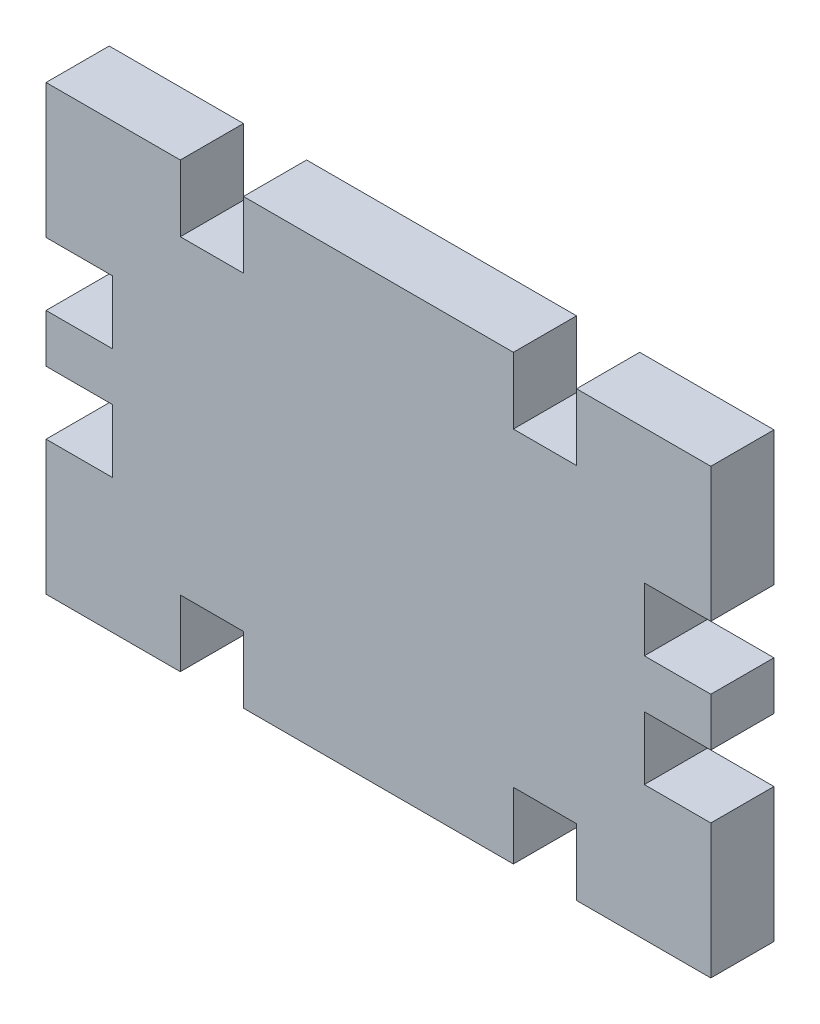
ISO-10303-21;
HEADER;
FILE_DESCRIPTION(('STEP AP214'),'2;1');
FILE_NAME('part.step','',(''),(''),'','','');
FILE_SCHEMA(('AUTOMOTIVE_DESIGN { 1 0 10303 214 1 1 1 1 }'));
ENDSEC;
DATA;
#1=APPLICATION_CONTEXT('core data for automotive mechanical design processes');
#2=APPLICATION_PROTOCOL_DEFINITION('international standard','automotive_design',2000,#1);
#3=PRODUCT_CONTEXT('',#1,'mechanical');
#4=PRODUCT('Part','Part','',(#3));
#5=PRODUCT_RELATED_PRODUCT_CATEGORY('part','',(#4));
#6=PRODUCT_DEFINITION_FORMATION('','',#4);
#7=PRODUCT_DEFINITION_CONTEXT('part definition',#1,'design');
#8=PRODUCT_DEFINITION('design','',#6,#7);
#9=PRODUCT_DEFINITION_SHAPE('','',#8);
#10=(LENGTH_UNIT() NAMED_UNIT(*) SI_UNIT(.MILLI.,.METRE.));
#11=(NAMED_UNIT(*) PLANE_ANGLE_UNIT() SI_UNIT($,.RADIAN.));
#12=(NAMED_UNIT(*) SI_UNIT($,.STERADIAN.) SOLID_ANGLE_UNIT());
#13=UNCERTAINTY_MEASURE_WITH_UNIT(LENGTH_MEASURE(1.E-05),#10,'distance_accuracy_value','');
#14=(GEOMETRIC_REPRESENTATION_CONTEXT(3) GLOBAL_UNCERTAINTY_ASSIGNED_CONTEXT((#13)) GLOBAL_UNIT_ASSIGNED_CONTEXT((#10,
#11,#12)) REPRESENTATION_CONTEXT('',''));
#15=CARTESIAN_POINT('',(0.,0.,0.));
#16=DIRECTION('',(0.,0.,1.));
#17=DIRECTION('',(1.,0.,0.));
#18=AXIS2_PLACEMENT_3D('',#15,#16,#17);
#19=CARTESIAN_POINT('',(21.6975142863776,12.7075775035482,5.7));
#20=DIRECTION('',(1.,0.,0.));
#21=DIRECTION('',(0.,1.,0.));
#22=AXIS2_PLACEMENT_3D('',#19,#20,#21);
#23=PLANE('',#22);
#24=DIRECTION('',(0.,-1.,0.));
#25=VECTOR('',#24,1.);
#26=CARTESIAN_POINT('',(21.6975142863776,12.7075775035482,0.));
#27=LINE('',#26,#25);
#28=CARTESIAN_POINT('',(21.6975142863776,-5.11077097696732,0.));
#29=VERTEX_POINT('',#28);
#30=CARTESIAN_POINT('',(21.6975142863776,-9.47407401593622,0.));
#31=VERTEX_POINT('',#30);
#32=EDGE_CURVE('E656',#29,#31,#27,.T.);
#33=ORIENTED_EDGE('',*,*,#32,.T.);
#34=DIRECTION('',(0.,0.,1.));
#35=VECTOR('',#34,1.);
#36=CARTESIAN_POINT('',(21.6975142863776,-9.47407401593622,-4.3));
#37=LINE('',#36,#35);
#38=CARTESIAN_POINT('',(21.6975142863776,-9.47407401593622,5.7));
#39=VERTEX_POINT('',#38);
#40=EDGE_CURVE('E421',#31,#39,#37,.T.);
#41=ORIENTED_EDGE('',*,*,#40,.T.);
#42=DIRECTION('',(0.,-1.,0.));
#43=VECTOR('',#42,1.);
#44=CARTESIAN_POINT('',(21.6975142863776,12.7075775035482,5.7));
#45=LINE('',#44,#43);
#46=CARTESIAN_POINT('',(21.6975142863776,-5.11077097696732,5.7));
#47=VERTEX_POINT('',#46);
#48=EDGE_CURVE('E288',#47,#39,#45,.T.);
#49=ORIENTED_EDGE('',*,*,#48,.F.);
#50=DIRECTION('',(0.,0.,1.));
#51=VECTOR('',#50,1.);
#52=CARTESIAN_POINT('',(21.6975142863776,-5.11077097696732,-4.3));
#53=LINE('',#52,#51);
#54=EDGE_CURVE('E457',#29,#47,#53,.T.);
#55=ORIENTED_EDGE('',*,*,#54,.F.);
#56=EDGE_LOOP('',(#33,#41,#49,#55));
#57=FACE_BOUND('',#56,.T.);
#58=ADVANCED_FACE('F32',(#57),#23,.F.);
#59=CARTESIAN_POINT('',(21.6975142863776,12.7075775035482,0.));
#60=VERTEX_POINT('',#59);
#61=CARTESIAN_POINT('',(21.6975142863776,0.589229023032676,0.));
#62=VERTEX_POINT('',#61);
#63=EDGE_CURVE('E643',#60,#62,#27,.T.);
#64=ORIENTED_EDGE('',*,*,#63,.T.);
#65=DIRECTION('',(0.,0.,1.));
#66=VECTOR('',#65,1.);
#67=CARTESIAN_POINT('',(21.6975142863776,0.589229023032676,-4.3));
#68=LINE('',#67,#66);
#69=CARTESIAN_POINT('',(21.6975142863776,0.589229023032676,5.7));
#70=VERTEX_POINT('',#69);
#71=EDGE_CURVE('E453',#62,#70,#68,.T.);
#72=ORIENTED_EDGE('',*,*,#71,.T.);
#73=CARTESIAN_POINT('',(21.6975142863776,12.7075775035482,5.7));
#74=VERTEX_POINT('',#73);
#75=EDGE_CURVE('E291',#74,#70,#45,.T.);
#76=ORIENTED_EDGE('',*,*,#75,.F.);
#77=DIRECTION('',(0.,0.,-1.));
#78=VECTOR('',#77,1.);
#79=CARTESIAN_POINT('',(21.6975142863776,12.7075775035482,5.7));
#80=LINE('',#79,#78);
#81=EDGE_CURVE('E331',#74,#60,#80,.T.);
#82=ORIENTED_EDGE('',*,*,#81,.T.);
#83=EDGE_LOOP('',(#64,#72,#76,#82));
#84=FACE_BOUND('',#83,.T.);
#85=ADVANCED_FACE('F642',(#84),#23,.F.);
#86=CARTESIAN_POINT('',(21.6975142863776,-27.2924224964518,5.7));
#87=DIRECTION('',(0.,1.,0.));
#88=DIRECTION('',(0.,0.,1.));
#89=AXIS2_PLACEMENT_3D('',#86,#87,#88);
#90=PLANE('',#89);
#91=DIRECTION('',(1.,0.,0.));
#92=VECTOR('',#91,1.);
#93=CARTESIAN_POINT('',(21.6975142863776,-27.2924224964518,0.));
#94=LINE('',#93,#92);
#95=CARTESIAN_POINT('',(39.5158627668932,-27.2924224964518,0.));
#96=VERTEX_POINT('',#95);
#97=CARTESIAN_POINT('',(63.8791658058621,-27.2924224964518,0.));
#98=VERTEX_POINT('',#97);
#99=EDGE_CURVE('E564',#96,#98,#94,.T.);
#100=ORIENTED_EDGE('',*,*,#99,.T.);
#101=DIRECTION('',(0.,0.,1.));
#102=VECTOR('',#101,1.);
#103=CARTESIAN_POINT('',(63.8791658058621,-27.2924224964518,-4.3));
#104=LINE('',#103,#102);
#105=CARTESIAN_POINT('',(63.8791658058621,-27.2924224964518,5.7));
#106=VERTEX_POINT('',#105);
#107=EDGE_CURVE('E481',#98,#106,#104,.T.);
#108=ORIENTED_EDGE('',*,*,#107,.T.);
#109=DIRECTION('',(1.,0.,0.));
#110=VECTOR('',#109,1.);
#111=CARTESIAN_POINT('',(21.6975142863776,-27.2924224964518,5.7));
#112=LINE('',#111,#110);
#113=CARTESIAN_POINT('',(39.5158627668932,-27.2924224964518,5.7));
#114=VERTEX_POINT('',#113);
#115=EDGE_CURVE('E303',#114,#106,#112,.T.);
#116=ORIENTED_EDGE('',*,*,#115,.F.);
#117=DIRECTION('',(0.,0.,1.));
#118=VECTOR('',#117,1.);
#119=CARTESIAN_POINT('',(39.5158627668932,-27.2924224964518,-4.3));
#120=LINE('',#119,#118);
#121=EDGE_CURVE('E541',#96,#114,#120,.T.);
#122=ORIENTED_EDGE('',*,*,#121,.F.);
#123=EDGE_LOOP('',(#100,#108,#116,#122));
#124=FACE_BOUND('',#123,.T.);
#125=ADVANCED_FACE('F563',(#124),#90,.F.);
#126=CARTESIAN_POINT('',(81.6975142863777,12.7075775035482,5.7));
#127=DIRECTION('',(-1.,0.,0.));
#128=DIRECTION('',(0.,-1.,0.));
#129=AXIS2_PLACEMENT_3D('',#126,#127,#128);
#130=PLANE('',#129);
#131=DIRECTION('',(0.,1.,0.));
#132=VECTOR('',#131,1.);
#133=CARTESIAN_POINT('',(81.6975142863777,12.7075775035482,0.));
#134=LINE('',#133,#132);
#135=CARTESIAN_POINT('',(81.6975142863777,-9.47407401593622,0.));
#136=VERTEX_POINT('',#135);
#137=CARTESIAN_POINT('',(81.6975142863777,-5.11077097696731,0.));
#138=VERTEX_POINT('',#137);
#139=EDGE_CURVE('E599',#136,#138,#134,.T.);
#140=ORIENTED_EDGE('',*,*,#139,.T.);
#141=DIRECTION('',(0.,0.,1.));
#142=VECTOR('',#141,1.);
#143=CARTESIAN_POINT('',(81.6975142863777,-5.11077097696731,-4.3));
#144=LINE('',#143,#142);
#145=CARTESIAN_POINT('',(81.6975142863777,-5.11077097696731,5.7));
#146=VERTEX_POINT('',#145);
#147=EDGE_CURVE('E447',#138,#146,#144,.T.);
#148=ORIENTED_EDGE('',*,*,#147,.T.);
#149=DIRECTION('',(0.,1.,0.));
#150=VECTOR('',#149,1.);
#151=CARTESIAN_POINT('',(81.6975142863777,12.7075775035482,5.7));
#152=LINE('',#151,#150);
#153=CARTESIAN_POINT('',(81.6975142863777,-9.47407401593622,5.7));
#154=VERTEX_POINT('',#153);
#155=EDGE_CURVE('E313',#154,#146,#152,.T.);
#156=ORIENTED_EDGE('',*,*,#155,.F.);
#157=DIRECTION('',(0.,0.,1.));
#158=VECTOR('',#157,1.);
#159=CARTESIAN_POINT('',(81.6975142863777,-9.47407401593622,-4.3));
#160=LINE('',#159,#158);
#161=EDGE_CURVE('E524',#136,#154,#160,.T.);
#162=ORIENTED_EDGE('',*,*,#161,.F.);
#163=EDGE_LOOP('',(#140,#148,#156,#162));
#164=FACE_BOUND('',#163,.T.);
#165=ADVANCED_FACE('F598',(#164),#130,.F.);
#166=CARTESIAN_POINT('',(81.6975142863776,-27.2924224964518,0.));
#167=VERTEX_POINT('',#166);
#168=CARTESIAN_POINT('',(81.6975142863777,-15.1740740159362,0.));
#169=VERTEX_POINT('',#168);
#170=EDGE_CURVE('E582',#167,#169,#134,.T.);
#171=ORIENTED_EDGE('',*,*,#170,.T.);
#172=DIRECTION('',(0.,0.,1.));
#173=VECTOR('',#172,1.);
#174=CARTESIAN_POINT('',(81.6975142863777,-15.1740740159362,-4.3));
#175=LINE('',#174,#173);
#176=CARTESIAN_POINT('',(81.6975142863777,-15.1740740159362,5.7));
#177=VERTEX_POINT('',#176);
#178=EDGE_CURVE('E520',#169,#177,#175,.T.);
#179=ORIENTED_EDGE('',*,*,#178,.T.);
#180=CARTESIAN_POINT('',(81.6975142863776,-27.2924224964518,5.7));
#181=VERTEX_POINT('',#180);
#182=EDGE_CURVE('E314',#181,#177,#152,.T.);
#183=ORIENTED_EDGE('',*,*,#182,.F.);
#184=DIRECTION('',(0.,0.,-1.));
#185=VECTOR('',#184,1.);
#186=CARTESIAN_POINT('',(81.6975142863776,-27.2924224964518,5.7));
#187=LINE('',#186,#185);
#188=EDGE_CURVE('E341',#181,#167,#187,.T.);
#189=ORIENTED_EDGE('',*,*,#188,.T.);
#190=EDGE_LOOP('',(#171,#179,#183,#189));
#191=FACE_BOUND('',#190,.T.);
#192=ADVANCED_FACE('F581',(#191),#130,.F.);
#193=CARTESIAN_POINT('',(21.6975142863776,12.7075775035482,5.7));
#194=DIRECTION('',(0.,-1.,0.));
#195=DIRECTION('',(0.,0.,-1.));
#196=AXIS2_PLACEMENT_3D('',#193,#194,#195);
#197=PLANE('',#196);
#198=DIRECTION('',(-1.,0.,0.));
#199=VECTOR('',#198,1.);
#200=CARTESIAN_POINT('',(21.6975142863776,12.7075775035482,0.));
#201=LINE('',#200,#199);
#202=CARTESIAN_POINT('',(63.8791658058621,12.7075775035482,0.));
#203=VERTEX_POINT('',#202);
#204=CARTESIAN_POINT('',(39.5158627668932,12.7075775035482,0.));
#205=VERTEX_POINT('',#204);
#206=EDGE_CURVE('E294',#203,#205,#201,.T.);
#207=ORIENTED_EDGE('',*,*,#206,.T.);
#208=DIRECTION('',(0.,0.,1.));
#209=VECTOR('',#208,1.);
#210=CARTESIAN_POINT('',(39.5158627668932,12.7075775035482,-4.3));
#211=LINE('',#210,#209);
#212=CARTESIAN_POINT('',(39.5158627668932,12.7075775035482,5.7));
#213=VERTEX_POINT('',#212);
#214=EDGE_CURVE('E283',#205,#213,#211,.T.);
#215=ORIENTED_EDGE('',*,*,#214,.T.);
#216=DIRECTION('',(-1.,0.,0.));
#217=VECTOR('',#216,1.);
#218=CARTESIAN_POINT('',(21.6975142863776,12.7075775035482,5.7));
#219=LINE('',#218,#217);
#220=CARTESIAN_POINT('',(63.8791658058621,12.7075775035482,5.7));
#221=VERTEX_POINT('',#220);
#222=EDGE_CURVE('E324',#221,#213,#219,.T.);
#223=ORIENTED_EDGE('',*,*,#222,.F.);
#224=DIRECTION('',(0.,0.,1.));
#225=VECTOR('',#224,1.);
#226=CARTESIAN_POINT('',(63.8791658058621,12.7075775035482,-4.3));
#227=LINE('',#226,#225);
#228=EDGE_CURVE('E491',#203,#221,#227,.T.);
#229=ORIENTED_EDGE('',*,*,#228,.F.);
#230=EDGE_LOOP('',(#207,#215,#223,#229));
#231=FACE_BOUND('',#230,.T.);
#232=ADVANCED_FACE('F631',(#231),#197,.F.);
#233=CARTESIAN_POINT('',(81.6975142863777,12.7075775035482,0.));
#234=VERTEX_POINT('',#233);
#235=CARTESIAN_POINT('',(69.5791658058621,12.7075775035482,0.));
#236=VERTEX_POINT('',#235);
#237=EDGE_CURVE('E289',#234,#236,#201,.T.);
#238=ORIENTED_EDGE('',*,*,#237,.T.);
#239=DIRECTION('',(0.,0.,1.));
#240=VECTOR('',#239,1.);
#241=CARTESIAN_POINT('',(69.5791658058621,12.7075775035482,-4.3));
#242=LINE('',#241,#240);
#243=CARTESIAN_POINT('',(69.5791658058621,12.7075775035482,5.7));
#244=VERTEX_POINT('',#243);
#245=EDGE_CURVE('E487',#236,#244,#242,.T.);
#246=ORIENTED_EDGE('',*,*,#245,.T.);
#247=CARTESIAN_POINT('',(81.6975142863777,12.7075775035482,5.7));
#248=VERTEX_POINT('',#247);
#249=EDGE_CURVE('E325',#248,#244,#219,.T.);
#250=ORIENTED_EDGE('',*,*,#249,.F.);
#251=DIRECTION('',(0.,0.,-1.));
#252=VECTOR('',#251,1.);
#253=CARTESIAN_POINT('',(81.6975142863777,12.7075775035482,5.7));
#254=LINE('',#253,#252);
#255=EDGE_CURVE('E335',#248,#234,#254,.T.);
#256=ORIENTED_EDGE('',*,*,#255,.T.);
#257=EDGE_LOOP('',(#238,#246,#250,#256));
#258=FACE_BOUND('',#257,.T.);
#259=ADVANCED_FACE('F615',(#258),#197,.F.);
#260=CARTESIAN_POINT('',(21.6975142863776,-27.2924224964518,0.));
#261=VERTEX_POINT('',#260);
#262=CARTESIAN_POINT('',(33.8158627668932,-27.2924224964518,0.));
#263=VERTEX_POINT('',#262);
#264=EDGE_CURVE('E547',#261,#263,#94,.T.);
#265=ORIENTED_EDGE('',*,*,#264,.T.);
#266=DIRECTION('',(0.,0.,1.));
#267=VECTOR('',#266,1.);
#268=CARTESIAN_POINT('',(33.8158627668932,-27.2924224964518,-4.3));
#269=LINE('',#268,#267);
#270=CARTESIAN_POINT('',(33.8158627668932,-27.2924224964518,5.7));
#271=VERTEX_POINT('',#270);
#272=EDGE_CURVE('E535',#263,#271,#269,.T.);
#273=ORIENTED_EDGE('',*,*,#272,.T.);
#274=CARTESIAN_POINT('',(21.6975142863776,-27.2924224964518,5.7));
#275=VERTEX_POINT('',#274);
#276=EDGE_CURVE('E304',#275,#271,#112,.T.);
#277=ORIENTED_EDGE('',*,*,#276,.F.);
#278=DIRECTION('',(0.,0.,-1.));
#279=VECTOR('',#278,1.);
#280=CARTESIAN_POINT('',(21.6975142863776,-27.2924224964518,5.7));
#281=LINE('',#280,#279);
#282=EDGE_CURVE('E287',#275,#261,#281,.T.);
#283=ORIENTED_EDGE('',*,*,#282,.T.);
#284=EDGE_LOOP('',(#265,#273,#277,#283));
#285=FACE_BOUND('',#284,.T.);
#286=ADVANCED_FACE('F545',(#285),#90,.F.);
#287=CARTESIAN_POINT('',(21.6975142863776,-15.1740740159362,5.7));
#288=VERTEX_POINT('',#287);
#289=EDGE_CURVE('E279',#288,#275,#45,.T.);
#290=ORIENTED_EDGE('',*,*,#289,.F.);
#291=DIRECTION('',(0.,0.,1.));
#292=VECTOR('',#291,1.);
#293=CARTESIAN_POINT('',(21.6975142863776,-15.1740740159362,-4.3));
#294=LINE('',#293,#292);
#295=CARTESIAN_POINT('',(21.6975142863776,-15.1740740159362,0.));
#296=VERTEX_POINT('',#295);
#297=EDGE_CURVE('E263',#296,#288,#294,.T.);
#298=ORIENTED_EDGE('',*,*,#297,.F.);
#299=EDGE_CURVE('E538',#296,#261,#27,.T.);
#300=ORIENTED_EDGE('',*,*,#299,.T.);
#301=ORIENTED_EDGE('',*,*,#282,.F.);
#302=EDGE_LOOP('',(#290,#298,#300,#301));
#303=FACE_BOUND('',#302,.T.);
#304=ADVANCED_FACE('F34',(#303),#23,.F.);
#305=CARTESIAN_POINT('',(69.5791658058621,-27.2924224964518,5.7));
#306=VERTEX_POINT('',#305);
#307=EDGE_CURVE('E300',#306,#181,#112,.T.);
#308=ORIENTED_EDGE('',*,*,#307,.F.);
#309=DIRECTION('',(0.,0.,1.));
#310=VECTOR('',#309,1.);
#311=CARTESIAN_POINT('',(69.5791658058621,-27.2924224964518,-4.3));
#312=LINE('',#311,#310);
#313=CARTESIAN_POINT('',(69.5791658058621,-27.2924224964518,0.));
#314=VERTEX_POINT('',#313);
#315=EDGE_CURVE('E504',#314,#306,#312,.T.);
#316=ORIENTED_EDGE('',*,*,#315,.F.);
#317=EDGE_CURVE('E577',#314,#167,#94,.T.);
#318=ORIENTED_EDGE('',*,*,#317,.T.);
#319=ORIENTED_EDGE('',*,*,#188,.F.);
#320=EDGE_LOOP('',(#308,#316,#318,#319));
#321=FACE_BOUND('',#320,.T.);
#322=ADVANCED_FACE('F576',(#321),#90,.F.);
#323=CARTESIAN_POINT('',(81.6975142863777,0.589229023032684,5.7));
#324=VERTEX_POINT('',#323);
#325=EDGE_CURVE('E311',#324,#248,#152,.T.);
#326=ORIENTED_EDGE('',*,*,#325,.F.);
#327=DIRECTION('',(0.,0.,1.));
#328=VECTOR('',#327,1.);
#329=CARTESIAN_POINT('',(81.6975142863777,0.589229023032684,-4.3));
#330=LINE('',#329,#328);
#331=CARTESIAN_POINT('',(81.6975142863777,0.589229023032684,0.));
#332=VERTEX_POINT('',#331);
#333=EDGE_CURVE('E470',#332,#324,#330,.T.);
#334=ORIENTED_EDGE('',*,*,#333,.F.);
#335=EDGE_CURVE('E612',#332,#234,#134,.T.);
#336=ORIENTED_EDGE('',*,*,#335,.T.);
#337=ORIENTED_EDGE('',*,*,#255,.F.);
#338=EDGE_LOOP('',(#326,#334,#336,#337));
#339=FACE_BOUND('',#338,.T.);
#340=ADVANCED_FACE('F611',(#339),#130,.F.);
#341=CARTESIAN_POINT('',(33.8158627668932,12.7075775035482,5.7));
#342=VERTEX_POINT('',#341);
#343=EDGE_CURVE('E321',#342,#74,#219,.T.);
#344=ORIENTED_EDGE('',*,*,#343,.F.);
#345=DIRECTION('',(0.,0.,1.));
#346=VECTOR('',#345,1.);
#347=CARTESIAN_POINT('',(33.8158627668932,12.7075775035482,-4.3));
#348=LINE('',#347,#346);
#349=CARTESIAN_POINT('',(33.8158627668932,12.7075775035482,0.));
#350=VERTEX_POINT('',#349);
#351=EDGE_CURVE('E437',#350,#342,#348,.T.);
#352=ORIENTED_EDGE('',*,*,#351,.F.);
#353=EDGE_CURVE('E296',#350,#60,#201,.T.);
#354=ORIENTED_EDGE('',*,*,#353,.T.);
#355=ORIENTED_EDGE('',*,*,#81,.F.);
#356=EDGE_LOOP('',(#344,#352,#354,#355));
#357=FACE_BOUND('',#356,.T.);
#358=ADVANCED_FACE('F641',(#357),#197,.F.);
#359=CARTESIAN_POINT('',(0.,0.,5.7));
#360=DIRECTION('',(0.,0.,1.));
#361=DIRECTION('',(1.,0.,0.));
#362=AXIS2_PLACEMENT_3D('',#359,#360,#361);
#363=PLANE('',#362);
#364=DIRECTION('',(-1.,0.,0.));
#365=VECTOR('',#364,1.);
#366=CARTESIAN_POINT('',(21.6975142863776,-9.47407401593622,5.7));
#367=LINE('',#366,#365);
#368=CARTESIAN_POINT('',(27.6975142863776,-9.47407401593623,5.7));
#369=VERTEX_POINT('',#368);
#370=EDGE_CURVE('E273',#369,#39,#367,.T.);
#371=ORIENTED_EDGE('',*,*,#370,.F.);
#372=DIRECTION('',(0.,1.,0.));
#373=VECTOR('',#372,1.);
#374=CARTESIAN_POINT('',(27.6975142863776,-15.1740740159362,5.7));
#375=LINE('',#374,#373);
#376=CARTESIAN_POINT('',(27.6975142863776,-15.1740740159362,5.7));
#377=VERTEX_POINT('',#376);
#378=EDGE_CURVE('E282',#377,#369,#375,.T.);
#379=ORIENTED_EDGE('',*,*,#378,.F.);
#380=DIRECTION('',(1.,0.,0.));
#381=VECTOR('',#380,1.);
#382=CARTESIAN_POINT('',(21.6975142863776,-15.1740740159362,5.7));
#383=LINE('',#382,#381);
#384=EDGE_CURVE('E266',#288,#377,#383,.T.);
#385=ORIENTED_EDGE('',*,*,#384,.F.);
#386=ORIENTED_EDGE('',*,*,#289,.T.);
#387=ORIENTED_EDGE('',*,*,#276,.T.);
#388=DIRECTION('',(0.,-1.,0.));
#389=VECTOR('',#388,1.);
#390=CARTESIAN_POINT('',(33.8158627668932,-27.2924224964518,5.7));
#391=LINE('',#390,#389);
#392=CARTESIAN_POINT('',(33.8158627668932,-21.2924224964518,5.7));
#393=VERTEX_POINT('',#392);
#394=EDGE_CURVE('E424',#393,#271,#391,.T.);
#395=ORIENTED_EDGE('',*,*,#394,.F.);
#396=DIRECTION('',(-1.,0.,0.));
#397=VECTOR('',#396,1.);
#398=CARTESIAN_POINT('',(33.8158627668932,-21.2924224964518,5.7));
#399=LINE('',#398,#397);
#400=CARTESIAN_POINT('',(39.5158627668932,-21.2924224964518,5.7));
#401=VERTEX_POINT('',#400);
#402=EDGE_CURVE('E532',#401,#393,#399,.T.);
#403=ORIENTED_EDGE('',*,*,#402,.F.);
#404=DIRECTION('',(0.,1.,0.));
#405=VECTOR('',#404,1.);
#406=CARTESIAN_POINT('',(39.5158627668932,-27.2924224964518,5.7));
#407=LINE('',#406,#405);
#408=EDGE_CURVE('E529',#114,#401,#407,.T.);
#409=ORIENTED_EDGE('',*,*,#408,.F.);
#410=ORIENTED_EDGE('',*,*,#115,.T.);
#411=DIRECTION('',(0.,-1.,0.));
#412=VECTOR('',#411,1.);
#413=CARTESIAN_POINT('',(63.8791658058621,-27.2924224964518,5.7));
#414=LINE('',#413,#412);
#415=CARTESIAN_POINT('',(63.8791658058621,-21.2924224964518,5.7));
#416=VERTEX_POINT('',#415);
#417=EDGE_CURVE('E502',#416,#106,#414,.T.);
#418=ORIENTED_EDGE('',*,*,#417,.F.);
#419=DIRECTION('',(-1.,0.,0.));
#420=VECTOR('',#419,1.);
#421=CARTESIAN_POINT('',(69.5791658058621,-21.2924224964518,5.7));
#422=LINE('',#421,#420);
#423=CARTESIAN_POINT('',(69.5791658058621,-21.2924224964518,5.7));
#424=VERTEX_POINT('',#423);
#425=EDGE_CURVE('E498',#424,#416,#422,.T.);
#426=ORIENTED_EDGE('',*,*,#425,.F.);
#427=DIRECTION('',(0.,1.,0.));
#428=VECTOR('',#427,1.);
#429=CARTESIAN_POINT('',(69.5791658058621,-27.2924224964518,5.7));
#430=LINE('',#429,#428);
#431=EDGE_CURVE('E495',#306,#424,#430,.T.);
#432=ORIENTED_EDGE('',*,*,#431,.F.);
#433=ORIENTED_EDGE('',*,*,#307,.T.);
#434=ORIENTED_EDGE('',*,*,#182,.T.);
#435=DIRECTION('',(1.,0.,0.));
#436=VECTOR('',#435,1.);
#437=CARTESIAN_POINT('',(81.6975142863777,-15.1740740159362,5.7));
#438=LINE('',#437,#436);
#439=CARTESIAN_POINT('',(75.6975142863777,-15.1740740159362,5.7));
#440=VERTEX_POINT('',#439);
#441=EDGE_CURVE('E512',#440,#177,#438,.T.);
#442=ORIENTED_EDGE('',*,*,#441,.F.);
#443=DIRECTION('',(0.,-1.,0.));
#444=VECTOR('',#443,1.);
#445=CARTESIAN_POINT('',(75.6975142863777,-15.1740740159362,5.7));
#446=LINE('',#445,#444);
#447=CARTESIAN_POINT('',(75.6975142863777,-9.47407401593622,5.7));
#448=VERTEX_POINT('',#447);
#449=EDGE_CURVE('E517',#448,#440,#446,.T.);
#450=ORIENTED_EDGE('',*,*,#449,.F.);
#451=DIRECTION('',(-1.,0.,0.));
#452=VECTOR('',#451,1.);
#453=CARTESIAN_POINT('',(81.6975142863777,-9.47407401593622,5.7));
#454=LINE('',#453,#452);
#455=EDGE_CURVE('E514',#154,#448,#454,.T.);
#456=ORIENTED_EDGE('',*,*,#455,.F.);
#457=ORIENTED_EDGE('',*,*,#155,.T.);
#458=DIRECTION('',(1.,0.,0.));
#459=VECTOR('',#458,1.);
#460=CARTESIAN_POINT('',(81.6975142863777,-5.11077097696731,5.7));
#461=LINE('',#460,#459);
#462=CARTESIAN_POINT('',(75.6975142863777,-5.11077097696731,5.7));
#463=VERTEX_POINT('',#462);
#464=EDGE_CURVE('E468',#463,#146,#461,.T.);
#465=ORIENTED_EDGE('',*,*,#464,.F.);
#466=DIRECTION('',(0.,-1.,0.));
#467=VECTOR('',#466,1.);
#468=CARTESIAN_POINT('',(75.6975142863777,0.589229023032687,5.7));
#469=LINE('',#468,#467);
#470=CARTESIAN_POINT('',(75.6975142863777,0.589229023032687,5.7));
#471=VERTEX_POINT('',#470);
#472=EDGE_CURVE('E464',#471,#463,#469,.T.);
#473=ORIENTED_EDGE('',*,*,#472,.F.);
#474=DIRECTION('',(-1.,0.,0.));
#475=VECTOR('',#474,1.);
#476=CARTESIAN_POINT('',(81.6975142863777,0.589229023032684,5.7));
#477=LINE('',#476,#475);
#478=EDGE_CURVE('E461',#324,#471,#477,.T.);
#479=ORIENTED_EDGE('',*,*,#478,.F.);
#480=ORIENTED_EDGE('',*,*,#325,.T.);
#481=ORIENTED_EDGE('',*,*,#249,.T.);
#482=DIRECTION('',(0.,1.,0.));
#483=VECTOR('',#482,1.);
#484=CARTESIAN_POINT('',(69.5791658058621,12.7075775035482,5.7));
#485=LINE('',#484,#483);
#486=CARTESIAN_POINT('',(69.5791658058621,6.70757750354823,5.7));
#487=VERTEX_POINT('',#486);
#488=EDGE_CURVE('E478',#487,#244,#485,.T.);
#489=ORIENTED_EDGE('',*,*,#488,.F.);
#490=DIRECTION('',(1.,0.,0.));
#491=VECTOR('',#490,1.);
#492=CARTESIAN_POINT('',(69.5791658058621,6.70757750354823,5.7));
#493=LINE('',#492,#491);
#494=CARTESIAN_POINT('',(63.8791658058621,6.70757750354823,5.7));
#495=VERTEX_POINT('',#494);
#496=EDGE_CURVE('E484',#495,#487,#493,.T.);
#497=ORIENTED_EDGE('',*,*,#496,.F.);
#498=DIRECTION('',(0.,-1.,0.));
#499=VECTOR('',#498,1.);
#500=CARTESIAN_POINT('',(63.8791658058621,12.7075775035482,5.7));
#501=LINE('',#500,#499);
#502=EDGE_CURVE('E480',#221,#495,#501,.T.);
#503=ORIENTED_EDGE('',*,*,#502,.F.);
#504=ORIENTED_EDGE('',*,*,#222,.T.);
#505=DIRECTION('',(0.,1.,0.));
#506=VECTOR('',#505,1.);
#507=CARTESIAN_POINT('',(39.5158627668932,12.7075775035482,5.7));
#508=LINE('',#507,#506);
#509=CARTESIAN_POINT('',(39.5158627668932,6.70757750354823,5.7));
#510=VERTEX_POINT('',#509);
#511=EDGE_CURVE('E435',#510,#213,#508,.T.);
#512=ORIENTED_EDGE('',*,*,#511,.F.);
#513=DIRECTION('',(1.,0.,0.));
#514=VECTOR('',#513,1.);
#515=CARTESIAN_POINT('',(33.8158627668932,6.70757750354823,5.7));
#516=LINE('',#515,#514);
#517=CARTESIAN_POINT('',(33.8158627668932,6.70757750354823,5.7));
#518=VERTEX_POINT('',#517);
#519=EDGE_CURVE('E431',#518,#510,#516,.T.);
#520=ORIENTED_EDGE('',*,*,#519,.F.);
#521=DIRECTION('',(0.,-1.,0.));
#522=VECTOR('',#521,1.);
#523=CARTESIAN_POINT('',(33.8158627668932,12.7075775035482,5.7));
#524=LINE('',#523,#522);
#525=EDGE_CURVE('E429',#342,#518,#524,.T.);
#526=ORIENTED_EDGE('',*,*,#525,.F.);
#527=ORIENTED_EDGE('',*,*,#343,.T.);
#528=ORIENTED_EDGE('',*,*,#75,.T.);
#529=DIRECTION('',(-1.,0.,0.));
#530=VECTOR('',#529,1.);
#531=CARTESIAN_POINT('',(21.6975142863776,0.589229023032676,5.7));
#532=LINE('',#531,#530);
#533=CARTESIAN_POINT('',(27.6975142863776,0.589229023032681,5.7));
#534=VERTEX_POINT('',#533);
#535=EDGE_CURVE('E444',#534,#70,#532,.T.);
#536=ORIENTED_EDGE('',*,*,#535,.F.);
#537=DIRECTION('',(0.,1.,0.));
#538=VECTOR('',#537,1.);
#539=CARTESIAN_POINT('',(27.6975142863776,0.589229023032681,5.7));
#540=LINE('',#539,#538);
#541=CARTESIAN_POINT('',(27.6975142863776,-5.11077097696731,5.7));
#542=VERTEX_POINT('',#541);
#543=EDGE_CURVE('E450',#542,#534,#540,.T.);
#544=ORIENTED_EDGE('',*,*,#543,.F.);
#545=DIRECTION('',(1.,0.,0.));
#546=VECTOR('',#545,1.);
#547=CARTESIAN_POINT('',(21.6975142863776,-5.11077097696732,5.7));
#548=LINE('',#547,#546);
#549=EDGE_CURVE('E446',#47,#542,#548,.T.);
#550=ORIENTED_EDGE('',*,*,#549,.F.);
#551=ORIENTED_EDGE('',*,*,#48,.T.);
#552=EDGE_LOOP('',(#371,#379,#385,#386,#387,#395,#403,#409,#410,#418,#426,#432,#433,#434,#442,
#450,#456,#457,#465,#473,#479,#480,#481,#489,#497,#503,#504,#512,#520,#526,#527,#528,#536,#544,
#550,#551));
#553=FACE_BOUND('',#552,.T.);
#554=ADVANCED_FACE('F277',(#553),#363,.T.);
#555=CARTESIAN_POINT('',(0.,0.,0.));
#556=DIRECTION('',(0.,0.,1.));
#557=DIRECTION('',(1.,0.,0.));
#558=AXIS2_PLACEMENT_3D('',#555,#556,#557);
#559=PLANE('',#558);
#560=DIRECTION('',(0.,1.,0.));
#561=VECTOR('',#560,1.);
#562=CARTESIAN_POINT('',(27.6975142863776,0.,0.));
#563=LINE('',#562,#561);
#564=CARTESIAN_POINT('',(27.6975142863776,-15.1740740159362,0.));
#565=VERTEX_POINT('',#564);
#566=CARTESIAN_POINT('',(27.6975142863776,-9.47407401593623,0.));
#567=VERTEX_POINT('',#566);
#568=EDGE_CURVE('E40',#565,#567,#563,.T.);
#569=ORIENTED_EDGE('',*,*,#568,.T.);
#570=DIRECTION('',(-1.,0.,0.));
#571=VECTOR('',#570,1.);
#572=CARTESIAN_POINT('',(0.,-9.47407401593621,0.));
#573=LINE('',#572,#571);
#574=EDGE_CURVE('E11',#567,#31,#573,.T.);
#575=ORIENTED_EDGE('',*,*,#574,.T.);
#576=ORIENTED_EDGE('',*,*,#32,.F.);
#577=DIRECTION('',(1.,0.,0.));
#578=VECTOR('',#577,1.);
#579=CARTESIAN_POINT('',(0.,-5.11077097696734,0.));
#580=LINE('',#579,#578);
#581=CARTESIAN_POINT('',(27.6975142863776,-5.11077097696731,0.));
#582=VERTEX_POINT('',#581);
#583=EDGE_CURVE('E393',#29,#582,#580,.T.);
#584=ORIENTED_EDGE('',*,*,#583,.T.);
#585=DIRECTION('',(0.,1.,0.));
#586=VECTOR('',#585,1.);
#587=CARTESIAN_POINT('',(27.6975142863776,0.,0.));
#588=LINE('',#587,#586);
#589=CARTESIAN_POINT('',(27.6975142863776,0.589229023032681,0.));
#590=VERTEX_POINT('',#589);
#591=EDGE_CURVE('E396',#582,#590,#588,.T.);
#592=ORIENTED_EDGE('',*,*,#591,.T.);
#593=DIRECTION('',(-1.,0.,0.));
#594=VECTOR('',#593,1.);
#595=CARTESIAN_POINT('',(0.,0.589229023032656,0.));
#596=LINE('',#595,#594);
#597=EDGE_CURVE('E399',#590,#62,#596,.T.);
#598=ORIENTED_EDGE('',*,*,#597,.T.);
#599=ORIENTED_EDGE('',*,*,#63,.F.);
#600=ORIENTED_EDGE('',*,*,#353,.F.);
#601=DIRECTION('',(0.,-1.,0.));
#602=VECTOR('',#601,1.);
#603=CARTESIAN_POINT('',(33.8158627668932,0.,0.));
#604=LINE('',#603,#602);
#605=CARTESIAN_POINT('',(33.8158627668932,6.70757750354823,0.));
#606=VERTEX_POINT('',#605);
#607=EDGE_CURVE('E402',#350,#606,#604,.T.);
#608=ORIENTED_EDGE('',*,*,#607,.T.);
#609=DIRECTION('',(1.,0.,0.));
#610=VECTOR('',#609,1.);
#611=CARTESIAN_POINT('',(0.,6.70757750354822,0.));
#612=LINE('',#611,#610);
#613=CARTESIAN_POINT('',(39.5158627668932,6.70757750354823,0.));
#614=VERTEX_POINT('',#613);
#615=EDGE_CURVE('E405',#606,#614,#612,.T.);
#616=ORIENTED_EDGE('',*,*,#615,.T.);
#617=DIRECTION('',(0.,1.,0.));
#618=VECTOR('',#617,1.);
#619=CARTESIAN_POINT('',(39.5158627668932,0.,0.));
#620=LINE('',#619,#618);
#621=EDGE_CURVE('E408',#614,#205,#620,.T.);
#622=ORIENTED_EDGE('',*,*,#621,.T.);
#623=ORIENTED_EDGE('',*,*,#206,.F.);
#624=DIRECTION('',(0.,-1.,0.));
#625=VECTOR('',#624,1.);
#626=CARTESIAN_POINT('',(63.8791658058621,0.,0.));
#627=LINE('',#626,#625);
#628=CARTESIAN_POINT('',(63.8791658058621,6.70757750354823,0.));
#629=VERTEX_POINT('',#628);
#630=EDGE_CURVE('E375',#203,#629,#627,.T.);
#631=ORIENTED_EDGE('',*,*,#630,.T.);
#632=DIRECTION('',(1.,0.,0.));
#633=VECTOR('',#632,1.);
#634=CARTESIAN_POINT('',(0.,6.70757750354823,0.));
#635=LINE('',#634,#633);
#636=CARTESIAN_POINT('',(69.5791658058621,6.70757750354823,0.));
#637=VERTEX_POINT('',#636);
#638=EDGE_CURVE('E378',#629,#637,#635,.T.);
#639=ORIENTED_EDGE('',*,*,#638,.T.);
#640=DIRECTION('',(0.,1.,0.));
#641=VECTOR('',#640,1.);
#642=CARTESIAN_POINT('',(69.5791658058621,1.60934149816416E-13,0.));
#643=LINE('',#642,#641);
#644=EDGE_CURVE('E381',#637,#236,#643,.T.);
#645=ORIENTED_EDGE('',*,*,#644,.T.);
#646=ORIENTED_EDGE('',*,*,#237,.F.);
#647=ORIENTED_EDGE('',*,*,#335,.F.);
#648=DIRECTION('',(-1.,0.,0.));
#649=VECTOR('',#648,1.);
#650=CARTESIAN_POINT('',(0.,0.589229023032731,0.));
#651=LINE('',#650,#649);
#652=CARTESIAN_POINT('',(75.6975142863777,0.589229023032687,0.));
#653=VERTEX_POINT('',#652);
#654=EDGE_CURVE('E384',#332,#653,#651,.T.);
#655=ORIENTED_EDGE('',*,*,#654,.T.);
#656=DIRECTION('',(0.,-1.,0.));
#657=VECTOR('',#656,1.);
#658=CARTESIAN_POINT('',(75.6975142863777,0.,0.));
#659=LINE('',#658,#657);
#660=CARTESIAN_POINT('',(75.6975142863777,-5.11077097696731,0.));
#661=VERTEX_POINT('',#660);
#662=EDGE_CURVE('E387',#653,#661,#659,.T.);
#663=ORIENTED_EDGE('',*,*,#662,.T.);
#664=DIRECTION('',(1.,0.,0.));
#665=VECTOR('',#664,1.);
#666=CARTESIAN_POINT('',(0.,-5.11077097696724,0.));
#667=LINE('',#666,#665);
#668=EDGE_CURVE('E390',#661,#138,#667,.T.);
#669=ORIENTED_EDGE('',*,*,#668,.T.);
#670=ORIENTED_EDGE('',*,*,#139,.F.);
#671=DIRECTION('',(-1.,0.,0.));
#672=VECTOR('',#671,1.);
#673=CARTESIAN_POINT('',(0.,-9.47407401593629,0.));
#674=LINE('',#673,#672);
#675=CARTESIAN_POINT('',(75.6975142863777,-9.47407401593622,0.));
#676=VERTEX_POINT('',#675);
#677=EDGE_CURVE('E357',#136,#676,#674,.T.);
#678=ORIENTED_EDGE('',*,*,#677,.T.);
#679=DIRECTION('',(0.,-1.,0.));
#680=VECTOR('',#679,1.);
#681=CARTESIAN_POINT('',(75.6975142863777,0.,0.));
#682=LINE('',#681,#680);
#683=CARTESIAN_POINT('',(75.6975142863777,-15.1740740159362,0.));
#684=VERTEX_POINT('',#683);
#685=EDGE_CURVE('E360',#676,#684,#682,.T.);
#686=ORIENTED_EDGE('',*,*,#685,.T.);
#687=DIRECTION('',(1.,0.,0.));
#688=VECTOR('',#687,1.);
#689=CARTESIAN_POINT('',(0.,-15.1740740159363,0.));
#690=LINE('',#689,#688);
#691=EDGE_CURVE('E363',#684,#169,#690,.T.);
#692=ORIENTED_EDGE('',*,*,#691,.T.);
#693=ORIENTED_EDGE('',*,*,#170,.F.);
#694=ORIENTED_EDGE('',*,*,#317,.F.);
#695=DIRECTION('',(0.,1.,0.));
#696=VECTOR('',#695,1.);
#697=CARTESIAN_POINT('',(69.5791658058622,-1.60934149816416E-13,0.));
#698=LINE('',#697,#696);
#699=CARTESIAN_POINT('',(69.5791658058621,-21.2924224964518,0.));
#700=VERTEX_POINT('',#699);
#701=EDGE_CURVE('E366',#314,#700,#698,.T.);
#702=ORIENTED_EDGE('',*,*,#701,.T.);
#703=DIRECTION('',(-1.,0.,0.));
#704=VECTOR('',#703,1.);
#705=CARTESIAN_POINT('',(0.,-21.2924224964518,0.));
#706=LINE('',#705,#704);
#707=CARTESIAN_POINT('',(63.8791658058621,-21.2924224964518,0.));
#708=VERTEX_POINT('',#707);
#709=EDGE_CURVE('E369',#700,#708,#706,.T.);
#710=ORIENTED_EDGE('',*,*,#709,.T.);
#711=DIRECTION('',(0.,-1.,0.));
#712=VECTOR('',#711,1.);
#713=CARTESIAN_POINT('',(63.8791658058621,0.,0.));
#714=LINE('',#713,#712);
#715=EDGE_CURVE('E372',#708,#98,#714,.T.);
#716=ORIENTED_EDGE('',*,*,#715,.T.);
#717=ORIENTED_EDGE('',*,*,#99,.F.);
#718=DIRECTION('',(0.,1.,0.));
#719=VECTOR('',#718,1.);
#720=CARTESIAN_POINT('',(39.5158627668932,0.,0.));
#721=LINE('',#720,#719);
#722=CARTESIAN_POINT('',(39.5158627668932,-21.2924224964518,0.));
#723=VERTEX_POINT('',#722);
#724=EDGE_CURVE('E348',#96,#723,#721,.T.);
#725=ORIENTED_EDGE('',*,*,#724,.T.);
#726=DIRECTION('',(-1.,0.,0.));
#727=VECTOR('',#726,1.);
#728=CARTESIAN_POINT('',(0.,-21.2924224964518,0.));
#729=LINE('',#728,#727);
#730=CARTESIAN_POINT('',(33.8158627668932,-21.2924224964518,0.));
#731=VERTEX_POINT('',#730);
#732=EDGE_CURVE('E351',#723,#731,#729,.T.);
#733=ORIENTED_EDGE('',*,*,#732,.T.);
#734=DIRECTION('',(0.,-1.,0.));
#735=VECTOR('',#734,1.);
#736=CARTESIAN_POINT('',(33.8158627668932,0.,0.));
#737=LINE('',#736,#735);
#738=EDGE_CURVE('E354',#731,#263,#737,.T.);
#739=ORIENTED_EDGE('',*,*,#738,.T.);
#740=ORIENTED_EDGE('',*,*,#264,.F.);
#741=ORIENTED_EDGE('',*,*,#299,.F.);
#742=DIRECTION('',(1.,0.,0.));
#743=VECTOR('',#742,1.);
#744=CARTESIAN_POINT('',(0.,-15.1740740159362,0.));
#745=LINE('',#744,#743);
#746=EDGE_CURVE('E269',#296,#565,#745,.T.);
#747=ORIENTED_EDGE('',*,*,#746,.T.);
#748=EDGE_LOOP('',(#569,#575,#576,#584,#592,#598,#599,#600,#608,#616,#622,#623,#631,#639,#645,
#646,#647,#655,#663,#669,#670,#678,#686,#692,#693,#694,#702,#710,#716,#717,#725,#733,#739,#740,
#741,#747));
#749=FACE_BOUND('',#748,.T.);
#750=ADVANCED_FACE('F413',(#749),#559,.F.);
#751=CARTESIAN_POINT('',(33.8158627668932,-27.2924224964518,-4.3));
#752=DIRECTION('',(-1.,0.,0.));
#753=DIRECTION('',(0.,0.,1.));
#754=AXIS2_PLACEMENT_3D('',#751,#752,#753);
#755=PLANE('',#754);
#756=DIRECTION('',(0.,0.,1.));
#757=VECTOR('',#756,1.);
#758=CARTESIAN_POINT('',(33.8158627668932,-21.2924224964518,-4.3));
#759=LINE('',#758,#757);
#760=EDGE_CURVE('E536',#731,#393,#759,.T.);
#761=ORIENTED_EDGE('',*,*,#760,.T.);
#762=ORIENTED_EDGE('',*,*,#394,.T.);
#763=ORIENTED_EDGE('',*,*,#272,.F.);
#764=ORIENTED_EDGE('',*,*,#738,.F.);
#765=EDGE_LOOP('',(#761,#762,#763,#764));
#766=FACE_BOUND('',#765,.T.);
#767=ADVANCED_FACE('F549',(#766),#755,.F.);
#768=CARTESIAN_POINT('',(33.8158627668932,-21.2924224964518,-4.3));
#769=DIRECTION('',(0.,1.,0.));
#770=DIRECTION('',(0.,0.,1.));
#771=AXIS2_PLACEMENT_3D('',#768,#769,#770);
#772=PLANE('',#771);
#773=DIRECTION('',(0.,0.,1.));
#774=VECTOR('',#773,1.);
#775=CARTESIAN_POINT('',(39.5158627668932,-21.2924224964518,-4.3));
#776=LINE('',#775,#774);
#777=EDGE_CURVE('E539',#723,#401,#776,.T.);
#778=ORIENTED_EDGE('',*,*,#777,.T.);
#779=ORIENTED_EDGE('',*,*,#402,.T.);
#780=ORIENTED_EDGE('',*,*,#760,.F.);
#781=ORIENTED_EDGE('',*,*,#732,.F.);
#782=EDGE_LOOP('',(#778,#779,#780,#781));
#783=FACE_BOUND('',#782,.T.);
#784=ADVANCED_FACE('F554',(#783),#772,.F.);
#785=CARTESIAN_POINT('',(39.5158627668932,-27.2924224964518,-4.3));
#786=DIRECTION('',(1.,0.,0.));
#787=DIRECTION('',(0.,0.,-1.));
#788=AXIS2_PLACEMENT_3D('',#785,#786,#787);
#789=PLANE('',#788);
#790=ORIENTED_EDGE('',*,*,#121,.T.);
#791=ORIENTED_EDGE('',*,*,#408,.T.);
#792=ORIENTED_EDGE('',*,*,#777,.F.);
#793=ORIENTED_EDGE('',*,*,#724,.F.);
#794=EDGE_LOOP('',(#790,#791,#792,#793));
#795=FACE_BOUND('',#794,.T.);
#796=ADVANCED_FACE('F760',(#795),#789,.F.);
#797=CARTESIAN_POINT('',(81.6975142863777,-15.1740740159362,-4.3));
#798=DIRECTION('',(0.,-1.,0.));
#799=DIRECTION('',(1.,0.,0.));
#800=AXIS2_PLACEMENT_3D('',#797,#798,#799);
#801=PLANE('',#800);
#802=DIRECTION('',(0.,0.,1.));
#803=VECTOR('',#802,1.);
#804=CARTESIAN_POINT('',(75.6975142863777,-15.1740740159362,-4.3));
#805=LINE('',#804,#803);
#806=EDGE_CURVE('E499',#684,#440,#805,.T.);
#807=ORIENTED_EDGE('',*,*,#806,.T.);
#808=ORIENTED_EDGE('',*,*,#441,.T.);
#809=ORIENTED_EDGE('',*,*,#178,.F.);
#810=ORIENTED_EDGE('',*,*,#691,.F.);
#811=EDGE_LOOP('',(#807,#808,#809,#810));
#812=FACE_BOUND('',#811,.T.);
#813=ADVANCED_FACE('F584',(#812),#801,.F.);
#814=CARTESIAN_POINT('',(75.6975142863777,-15.1740740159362,-4.3));
#815=DIRECTION('',(-1.,0.,0.));
#816=DIRECTION('',(0.,0.,1.));
#817=AXIS2_PLACEMENT_3D('',#814,#815,#816);
#818=PLANE('',#817);
#819=DIRECTION('',(0.,0.,1.));
#820=VECTOR('',#819,1.);
#821=CARTESIAN_POINT('',(75.6975142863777,-9.47407401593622,-4.3));
#822=LINE('',#821,#820);
#823=EDGE_CURVE('E522',#676,#448,#822,.T.);
#824=ORIENTED_EDGE('',*,*,#823,.T.);
#825=ORIENTED_EDGE('',*,*,#449,.T.);
#826=ORIENTED_EDGE('',*,*,#806,.F.);
#827=ORIENTED_EDGE('',*,*,#685,.F.);
#828=EDGE_LOOP('',(#824,#825,#826,#827));
#829=FACE_BOUND('',#828,.T.);
#830=ADVANCED_FACE('F589',(#829),#818,.F.);
#831=CARTESIAN_POINT('',(81.6975142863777,-9.47407401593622,-4.3));
#832=DIRECTION('',(0.,1.,0.));
#833=DIRECTION('',(-1.,0.,0.));
#834=AXIS2_PLACEMENT_3D('',#831,#832,#833);
#835=PLANE('',#834);
#836=ORIENTED_EDGE('',*,*,#161,.T.);
#837=ORIENTED_EDGE('',*,*,#455,.T.);
#838=ORIENTED_EDGE('',*,*,#823,.F.);
#839=ORIENTED_EDGE('',*,*,#677,.F.);
#840=EDGE_LOOP('',(#836,#837,#838,#839));
#841=FACE_BOUND('',#840,.T.);
#842=ADVANCED_FACE('F785',(#841),#835,.F.);
#843=CARTESIAN_POINT('',(63.8791658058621,-27.2924224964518,-4.3));
#844=DIRECTION('',(-1.,0.,0.));
#845=DIRECTION('',(0.,0.,1.));
#846=AXIS2_PLACEMENT_3D('',#843,#844,#845);
#847=PLANE('',#846);
#848=DIRECTION('',(0.,0.,1.));
#849=VECTOR('',#848,1.);
#850=CARTESIAN_POINT('',(63.8791658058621,-21.2924224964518,-4.3));
#851=LINE('',#850,#849);
#852=EDGE_CURVE('E507',#708,#416,#851,.T.);
#853=ORIENTED_EDGE('',*,*,#852,.T.);
#854=ORIENTED_EDGE('',*,*,#417,.T.);
#855=ORIENTED_EDGE('',*,*,#107,.F.);
#856=ORIENTED_EDGE('',*,*,#715,.F.);
#857=EDGE_LOOP('',(#853,#854,#855,#856));
#858=FACE_BOUND('',#857,.T.);
#859=ADVANCED_FACE('F566',(#858),#847,.F.);
#860=CARTESIAN_POINT('',(69.5791658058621,-21.2924224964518,-4.3));
#861=DIRECTION('',(0.,1.,0.));
#862=DIRECTION('',(0.,0.,1.));
#863=AXIS2_PLACEMENT_3D('',#860,#861,#862);
#864=PLANE('',#863);
#865=DIRECTION('',(0.,0.,1.));
#866=VECTOR('',#865,1.);
#867=CARTESIAN_POINT('',(69.5791658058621,-21.2924224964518,-4.3));
#868=LINE('',#867,#866);
#869=EDGE_CURVE('E509',#700,#424,#868,.T.);
#870=ORIENTED_EDGE('',*,*,#869,.T.);
#871=ORIENTED_EDGE('',*,*,#425,.T.);
#872=ORIENTED_EDGE('',*,*,#852,.F.);
#873=ORIENTED_EDGE('',*,*,#709,.F.);
#874=EDGE_LOOP('',(#870,#871,#872,#873));
#875=FACE_BOUND('',#874,.T.);
#876=ADVANCED_FACE('F571',(#875),#864,.F.);
#877=CARTESIAN_POINT('',(69.5791658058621,-27.2924224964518,-4.3));
#878=DIRECTION('',(1.,0.,0.));
#879=DIRECTION('',(0.,1.,0.));
#880=AXIS2_PLACEMENT_3D('',#877,#878,#879);
#881=PLANE('',#880);
#882=ORIENTED_EDGE('',*,*,#315,.T.);
#883=ORIENTED_EDGE('',*,*,#431,.T.);
#884=ORIENTED_EDGE('',*,*,#869,.F.);
#885=ORIENTED_EDGE('',*,*,#701,.F.);
#886=EDGE_LOOP('',(#882,#883,#884,#885));
#887=FACE_BOUND('',#886,.T.);
#888=ADVANCED_FACE('F810',(#887),#881,.F.);
#889=CARTESIAN_POINT('',(69.5791658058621,12.7075775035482,-4.3));
#890=DIRECTION('',(1.,0.,0.));
#891=DIRECTION('',(0.,1.,0.));
#892=AXIS2_PLACEMENT_3D('',#889,#890,#891);
#893=PLANE('',#892);
#894=DIRECTION('',(0.,0.,1.));
#895=VECTOR('',#894,1.);
#896=CARTESIAN_POINT('',(69.5791658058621,6.70757750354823,-4.3));
#897=LINE('',#896,#895);
#898=EDGE_CURVE('E465',#637,#487,#897,.T.);
#899=ORIENTED_EDGE('',*,*,#898,.T.);
#900=ORIENTED_EDGE('',*,*,#488,.T.);
#901=ORIENTED_EDGE('',*,*,#245,.F.);
#902=ORIENTED_EDGE('',*,*,#644,.F.);
#903=EDGE_LOOP('',(#899,#900,#901,#902));
#904=FACE_BOUND('',#903,.T.);
#905=ADVANCED_FACE('F617',(#904),#893,.F.);
#906=CARTESIAN_POINT('',(69.5791658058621,6.70757750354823,-4.3));
#907=DIRECTION('',(0.,-1.,0.));
#908=DIRECTION('',(0.,0.,-1.));
#909=AXIS2_PLACEMENT_3D('',#906,#907,#908);
#910=PLANE('',#909);
#911=DIRECTION('',(0.,0.,1.));
#912=VECTOR('',#911,1.);
#913=CARTESIAN_POINT('',(63.8791658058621,6.70757750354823,-4.3));
#914=LINE('',#913,#912);
#915=EDGE_CURVE('E489',#629,#495,#914,.T.);
#916=ORIENTED_EDGE('',*,*,#915,.T.);
#917=ORIENTED_EDGE('',*,*,#496,.T.);
#918=ORIENTED_EDGE('',*,*,#898,.F.);
#919=ORIENTED_EDGE('',*,*,#638,.F.);
#920=EDGE_LOOP('',(#916,#917,#918,#919));
#921=FACE_BOUND('',#920,.T.);
#922=ADVANCED_FACE('F622',(#921),#910,.F.);
#923=CARTESIAN_POINT('',(63.8791658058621,12.7075775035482,-4.3));
#924=DIRECTION('',(-1.,0.,0.));
#925=DIRECTION('',(0.,0.,1.));
#926=AXIS2_PLACEMENT_3D('',#923,#924,#925);
#927=PLANE('',#926);
#928=ORIENTED_EDGE('',*,*,#228,.T.);
#929=ORIENTED_EDGE('',*,*,#502,.T.);
#930=ORIENTED_EDGE('',*,*,#915,.F.);
#931=ORIENTED_EDGE('',*,*,#630,.F.);
#932=EDGE_LOOP('',(#928,#929,#930,#931));
#933=FACE_BOUND('',#932,.T.);
#934=ADVANCED_FACE('F835',(#933),#927,.F.);
#935=CARTESIAN_POINT('',(81.6975142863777,-5.11077097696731,-4.3));
#936=DIRECTION('',(0.,-1.,0.));
#937=DIRECTION('',(1.,0.,0.));
#938=AXIS2_PLACEMENT_3D('',#935,#936,#937);
#939=PLANE('',#938);
#940=DIRECTION('',(0.,0.,1.));
#941=VECTOR('',#940,1.);
#942=CARTESIAN_POINT('',(75.6975142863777,-5.11077097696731,-4.3));
#943=LINE('',#942,#941);
#944=EDGE_CURVE('E473',#661,#463,#943,.T.);
#945=ORIENTED_EDGE('',*,*,#944,.T.);
#946=ORIENTED_EDGE('',*,*,#464,.T.);
#947=ORIENTED_EDGE('',*,*,#147,.F.);
#948=ORIENTED_EDGE('',*,*,#668,.F.);
#949=EDGE_LOOP('',(#945,#946,#947,#948));
#950=FACE_BOUND('',#949,.T.);
#951=ADVANCED_FACE('F601',(#950),#939,.F.);
#952=CARTESIAN_POINT('',(75.6975142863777,0.589229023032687,-4.3));
#953=DIRECTION('',(-1.,0.,0.));
#954=DIRECTION('',(0.,0.,1.));
#955=AXIS2_PLACEMENT_3D('',#952,#953,#954);
#956=PLANE('',#955);
#957=DIRECTION('',(0.,0.,1.));
#958=VECTOR('',#957,1.);
#959=CARTESIAN_POINT('',(75.6975142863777,0.589229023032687,-4.3));
#960=LINE('',#959,#958);
#961=EDGE_CURVE('E475',#653,#471,#960,.T.);
#962=ORIENTED_EDGE('',*,*,#961,.T.);
#963=ORIENTED_EDGE('',*,*,#472,.T.);
#964=ORIENTED_EDGE('',*,*,#944,.F.);
#965=ORIENTED_EDGE('',*,*,#662,.F.);
#966=EDGE_LOOP('',(#962,#963,#964,#965));
#967=FACE_BOUND('',#966,.T.);
#968=ADVANCED_FACE('F606',(#967),#956,.F.);
#969=CARTESIAN_POINT('',(81.6975142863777,0.589229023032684,-4.3));
#970=DIRECTION('',(0.,1.,0.));
#971=DIRECTION('',(-1.,0.,0.));
#972=AXIS2_PLACEMENT_3D('',#969,#970,#971);
#973=PLANE('',#972);
#974=ORIENTED_EDGE('',*,*,#333,.T.);
#975=ORIENTED_EDGE('',*,*,#478,.T.);
#976=ORIENTED_EDGE('',*,*,#961,.F.);
#977=ORIENTED_EDGE('',*,*,#654,.F.);
#978=EDGE_LOOP('',(#974,#975,#976,#977));
#979=FACE_BOUND('',#978,.T.);
#980=ADVANCED_FACE('F860',(#979),#973,.F.);
#981=CARTESIAN_POINT('',(21.6975142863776,0.589229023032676,-4.3));
#982=DIRECTION('',(0.,1.,0.));
#983=DIRECTION('',(-1.,0.,0.));
#984=AXIS2_PLACEMENT_3D('',#981,#982,#983);
#985=PLANE('',#984);
#986=DIRECTION('',(0.,0.,1.));
#987=VECTOR('',#986,1.);
#988=CARTESIAN_POINT('',(27.6975142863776,0.589229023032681,-4.3));
#989=LINE('',#988,#987);
#990=EDGE_CURVE('E432',#590,#534,#989,.T.);
#991=ORIENTED_EDGE('',*,*,#990,.T.);
#992=ORIENTED_EDGE('',*,*,#535,.T.);
#993=ORIENTED_EDGE('',*,*,#71,.F.);
#994=ORIENTED_EDGE('',*,*,#597,.F.);
#995=EDGE_LOOP('',(#991,#992,#993,#994));
#996=FACE_BOUND('',#995,.T.);
#997=ADVANCED_FACE('F645',(#996),#985,.F.);
#998=CARTESIAN_POINT('',(27.6975142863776,0.589229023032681,-4.3));
#999=DIRECTION('',(1.,0.,0.));
#1000=DIRECTION('',(0.,1.,0.));
#1001=AXIS2_PLACEMENT_3D('',#998,#999,#1000);
#1002=PLANE('',#1001);
#1003=DIRECTION('',(0.,0.,1.));
#1004=VECTOR('',#1003,1.);
#1005=CARTESIAN_POINT('',(27.6975142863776,-5.11077097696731,-4.3));
#1006=LINE('',#1005,#1004);
#1007=EDGE_CURVE('E455',#582,#542,#1006,.T.);
#1008=ORIENTED_EDGE('',*,*,#1007,.T.);
#1009=ORIENTED_EDGE('',*,*,#543,.T.);
#1010=ORIENTED_EDGE('',*,*,#990,.F.);
#1011=ORIENTED_EDGE('',*,*,#591,.F.);
#1012=EDGE_LOOP('',(#1008,#1009,#1010,#1011));
#1013=FACE_BOUND('',#1012,.T.);
#1014=ADVANCED_FACE('F649',(#1013),#1002,.F.);
#1015=CARTESIAN_POINT('',(21.6975142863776,-5.11077097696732,-4.3));
#1016=DIRECTION('',(0.,-1.,0.));
#1017=DIRECTION('',(1.,0.,0.));
#1018=AXIS2_PLACEMENT_3D('',#1015,#1016,#1017);
#1019=PLANE('',#1018);
#1020=ORIENTED_EDGE('',*,*,#54,.T.);
#1021=ORIENTED_EDGE('',*,*,#549,.T.);
#1022=ORIENTED_EDGE('',*,*,#1007,.F.);
#1023=ORIENTED_EDGE('',*,*,#583,.F.);
#1024=EDGE_LOOP('',(#1020,#1021,#1022,#1023));
#1025=FACE_BOUND('',#1024,.T.);
#1026=ADVANCED_FACE('F885',(#1025),#1019,.F.);
#1027=CARTESIAN_POINT('',(39.5158627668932,12.7075775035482,-4.3));
#1028=DIRECTION('',(1.,0.,0.));
#1029=DIRECTION('',(0.,0.,-1.));
#1030=AXIS2_PLACEMENT_3D('',#1027,#1028,#1029);
#1031=PLANE('',#1030);
#1032=DIRECTION('',(0.,0.,1.));
#1033=VECTOR('',#1032,1.);
#1034=CARTESIAN_POINT('',(39.5158627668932,6.70757750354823,-4.3));
#1035=LINE('',#1034,#1033);
#1036=EDGE_CURVE('E440',#614,#510,#1035,.T.);
#1037=ORIENTED_EDGE('',*,*,#1036,.T.);
#1038=ORIENTED_EDGE('',*,*,#511,.T.);
#1039=ORIENTED_EDGE('',*,*,#214,.F.);
#1040=ORIENTED_EDGE('',*,*,#621,.F.);
#1041=EDGE_LOOP('',(#1037,#1038,#1039,#1040));
#1042=FACE_BOUND('',#1041,.T.);
#1043=ADVANCED_FACE('F633',(#1042),#1031,.F.);
#1044=CARTESIAN_POINT('',(33.8158627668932,6.70757750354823,-4.3));
#1045=DIRECTION('',(0.,-1.,0.));
#1046=DIRECTION('',(1.,0.,0.));
#1047=AXIS2_PLACEMENT_3D('',#1044,#1045,#1046);
#1048=PLANE('',#1047);
#1049=DIRECTION('',(0.,0.,1.));
#1050=VECTOR('',#1049,1.);
#1051=CARTESIAN_POINT('',(33.8158627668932,6.70757750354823,-4.3));
#1052=LINE('',#1051,#1050);
#1053=EDGE_CURVE('E55',#606,#518,#1052,.T.);
#1054=ORIENTED_EDGE('',*,*,#1053,.T.);
#1055=ORIENTED_EDGE('',*,*,#519,.T.);
#1056=ORIENTED_EDGE('',*,*,#1036,.F.);
#1057=ORIENTED_EDGE('',*,*,#615,.F.);
#1058=EDGE_LOOP('',(#1054,#1055,#1056,#1057));
#1059=FACE_BOUND('',#1058,.T.);
#1060=ADVANCED_FACE('F637',(#1059),#1048,.F.);
#1061=CARTESIAN_POINT('',(33.8158627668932,12.7075775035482,-4.3));
#1062=DIRECTION('',(-1.,0.,0.));
#1063=DIRECTION('',(0.,-1.,0.));
#1064=AXIS2_PLACEMENT_3D('',#1061,#1062,#1063);
#1065=PLANE('',#1064);
#1066=ORIENTED_EDGE('',*,*,#351,.T.);
#1067=ORIENTED_EDGE('',*,*,#525,.T.);
#1068=ORIENTED_EDGE('',*,*,#1053,.F.);
#1069=ORIENTED_EDGE('',*,*,#607,.F.);
#1070=EDGE_LOOP('',(#1066,#1067,#1068,#1069));
#1071=FACE_BOUND('',#1070,.T.);
#1072=ADVANCED_FACE('F660',(#1071),#1065,.F.);
#1073=CARTESIAN_POINT('',(21.6975142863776,-9.47407401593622,-4.3));
#1074=DIRECTION('',(0.,1.,0.));
#1075=DIRECTION('',(-1.,0.,0.));
#1076=AXIS2_PLACEMENT_3D('',#1073,#1074,#1075);
#1077=PLANE('',#1076);
#1078=DIRECTION('',(0.,0.,1.));
#1079=VECTOR('',#1078,1.);
#1080=CARTESIAN_POINT('',(27.6975142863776,-9.47407401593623,-4.3));
#1081=LINE('',#1080,#1079);
#1082=EDGE_CURVE('E419',#567,#369,#1081,.T.);
#1083=ORIENTED_EDGE('',*,*,#1082,.T.);
#1084=ORIENTED_EDGE('',*,*,#370,.T.);
#1085=ORIENTED_EDGE('',*,*,#40,.F.);
#1086=ORIENTED_EDGE('',*,*,#574,.F.);
#1087=EDGE_LOOP('',(#1083,#1084,#1085,#1086));
#1088=FACE_BOUND('',#1087,.T.);
#1089=ADVANCED_FACE('F657',(#1088),#1077,.F.);
#1090=CARTESIAN_POINT('',(27.6975142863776,-15.1740740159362,-4.3));
#1091=DIRECTION('',(1.,0.,0.));
#1092=DIRECTION('',(0.,0.,-1.));
#1093=AXIS2_PLACEMENT_3D('',#1090,#1091,#1092);
#1094=PLANE('',#1093);
#1095=DIRECTION('',(0.,0.,1.));
#1096=VECTOR('',#1095,1.);
#1097=CARTESIAN_POINT('',(27.6975142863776,-15.1740740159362,-4.3));
#1098=LINE('',#1097,#1096);
#1099=EDGE_CURVE('E47',#565,#377,#1098,.T.);
#1100=ORIENTED_EDGE('',*,*,#1099,.T.);
#1101=ORIENTED_EDGE('',*,*,#378,.T.);
#1102=ORIENTED_EDGE('',*,*,#1082,.F.);
#1103=ORIENTED_EDGE('',*,*,#568,.F.);
#1104=EDGE_LOOP('',(#1100,#1101,#1102,#1103));
#1105=FACE_BOUND('',#1104,.T.);
#1106=ADVANCED_FACE('F418',(#1105),#1094,.F.);
#1107=CARTESIAN_POINT('',(21.6975142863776,-15.1740740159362,-4.3));
#1108=DIRECTION('',(0.,-1.,0.));
#1109=DIRECTION('',(1.,0.,0.));
#1110=AXIS2_PLACEMENT_3D('',#1107,#1108,#1109);
#1111=PLANE('',#1110);
#1112=ORIENTED_EDGE('',*,*,#297,.T.);
#1113=ORIENTED_EDGE('',*,*,#384,.T.);
#1114=ORIENTED_EDGE('',*,*,#1099,.F.);
#1115=ORIENTED_EDGE('',*,*,#746,.F.);
#1116=EDGE_LOOP('',(#1112,#1113,#1114,#1115));
#1117=FACE_BOUND('',#1116,.T.);
#1118=ADVANCED_FACE('F265',(#1117),#1111,.F.);
#1119=CLOSED_SHELL('',(#58,#85,#125,#165,#192,#232,#259,#286,#304,#322,#340,#358,#554,#750,#767,
#784,#796,#813,#830,#842,#859,#876,#888,#905,#922,#934,#951,#968,#980,#997,#1014,#1026,#1043,
#1060,#1072,#1089,#1106,#1118));
#1120=MANIFOLD_SOLID_BREP('B2',#1119);
#1121=ADVANCED_BREP_SHAPE_REPRESENTATION('',(#18,#1120),#14);
#1122=SHAPE_DEFINITION_REPRESENTATION(#9,#1121);
ENDSEC;
END-ISO-10303-21;
